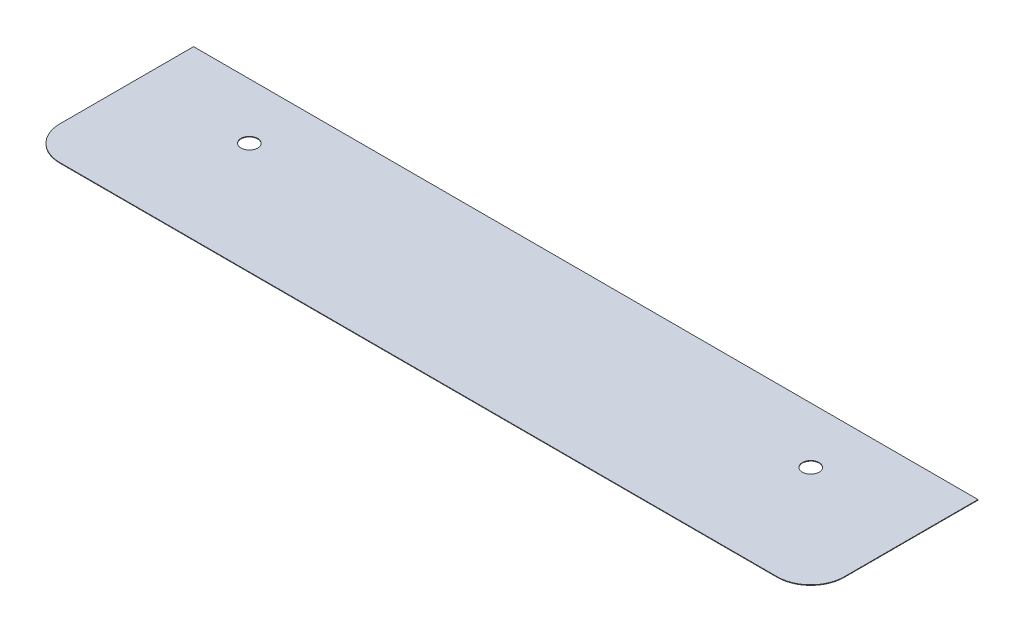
from build123d import *

# Parameters (mm, degrees)
SKETCH1_W           = 3573.78
SKETCH1_H           = 762
BOSS_EXTRUDE1_DEPTH = 2.54
CUT_EXTRUDE1_DEPTH  = 2.54
SKETCH3_R           = 38.1
CUT_EXTRUDE2_DEPTH  = 2.54


with BuildPart() as part:
    # Sketch1 → Boss-Extrude1 (new body)
    with BuildSketch(Plane(origin=(0, 0, 0), x_dir=(1, 0, 0), z_dir=(0, 1, 0))):
        with Locations((1786.89, 381)):
            Rectangle(SKETCH1_W, SKETCH1_H)
    extrude(amount=BOSS_EXTRUDE1_DEPTH)

    # Sketch2 → Cut-Extrude1 (cut)
    with BuildSketch(Plane(origin=(0, 2.54, 0), x_dir=(1, 0, 0), z_dir=(0, 1, 0))):
        with BuildLine():
            Line((0, 152.4), (0, 0))
            Line((0, 0), (152.4, 0))
            ThreePointArc((152.4, 0), (44.636926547, 44.636926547), (0, 152.4))
        make_face()
        with BuildLine():
            Line((3573.78, 0), (3421.38, 0))
            ThreePointArc((3421.38, 0), (3529.143073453, 44.636926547), (3573.78, 152.4))
            Line((3573.78, 152.4), (3573.78, 0))
        make_face()
    extrude(amount=-CUT_EXTRUDE1_DEPTH, mode=Mode.SUBTRACT)

    # Sketch3 → Cut-Extrude2 (cut)
    with BuildSketch(Plane(origin=(0, 2.54, 0), x_dir=(1, 0, 0), z_dir=(0, 1, 0))):
        with Locations(Location((508, 508, 0), (0, 0, 270))):
            Circle(SKETCH3_R)
        with Locations(Location((3065.78, 508, 0), (0, 0, 90))):
            Circle(SKETCH3_R)
    extrude(amount=-CUT_EXTRUDE2_DEPTH, mode=Mode.SUBTRACT)


solid = part.part
